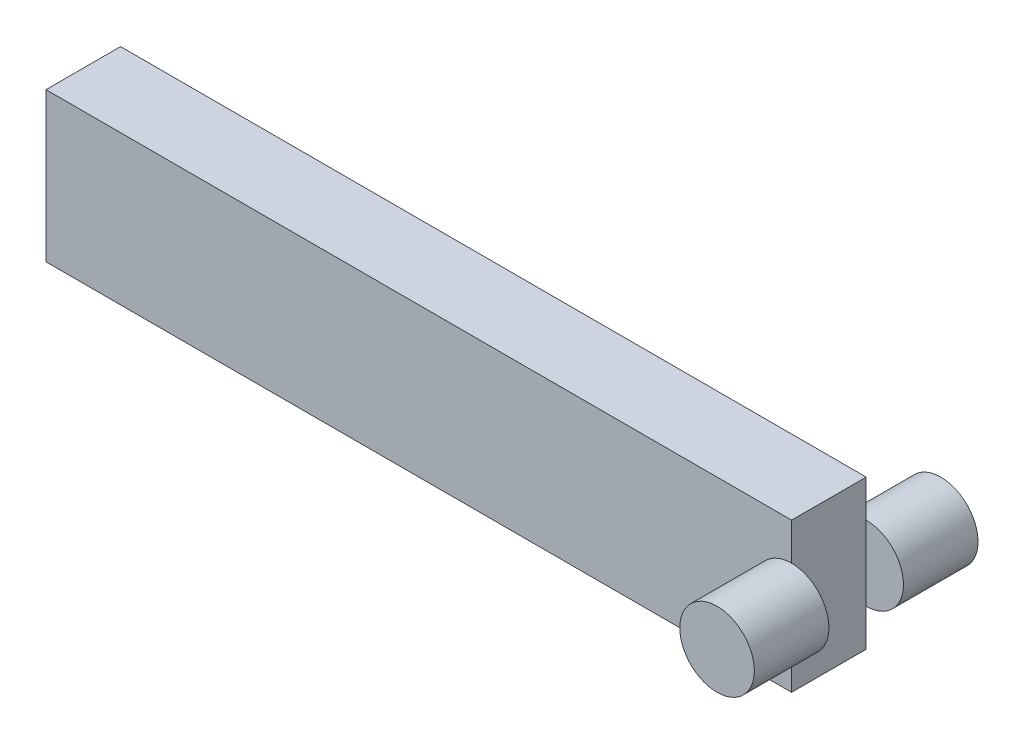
from build123d import *

# Parameters (mm, degrees)
BOSS_EXTRUDE1_DEPTH      = 10
BOSS_EXTRUDE1_DEPTH_BACK = 10
SKETCH1_W                = 200
SKETCH1_H                = 40
SKETCH2_R                = 10
BOSS_EXTRUDE2_DEPTH      = 20
BOSS_EXTRUDE3_START      = 20
SKETCH3_R                = 10
BOSS_EXTRUDE3_DEPTH      = 20


with BuildPart() as part:
    # Sketch1 → Boss-Extrude1 (new, two sides: drawn at the far end of the back side and taken through both)
    with BuildSketch(Plane.XY.offset(-BOSS_EXTRUDE1_DEPTH_BACK)):
        Rectangle(SKETCH1_W, SKETCH1_H)
    extrude(amount=BOSS_EXTRUDE1_DEPTH + BOSS_EXTRUDE1_DEPTH_BACK)

    # Sketch2 → Boss-Extrude2 (add)
    with BuildSketch(Plane(origin=(0, 0, -10), x_dir=(-1, 0, 0), z_dir=(0, 0, -1))):
        with Locations(Location((-100, 0, 0), (0, 0, 270))):
            Circle(SKETCH2_R)
    extrude(amount=BOSS_EXTRUDE2_DEPTH)

    # Sketch3 → Boss-Extrude3 (add)
    with BuildSketch(Plane.XY.offset(10).offset(BOSS_EXTRUDE3_START)):
        with Locations(Location((100, 0, 0), (0, 0, 270))):
            Circle(SKETCH3_R)
    extrude(amount=-BOSS_EXTRUDE3_DEPTH)


solid = part.part
